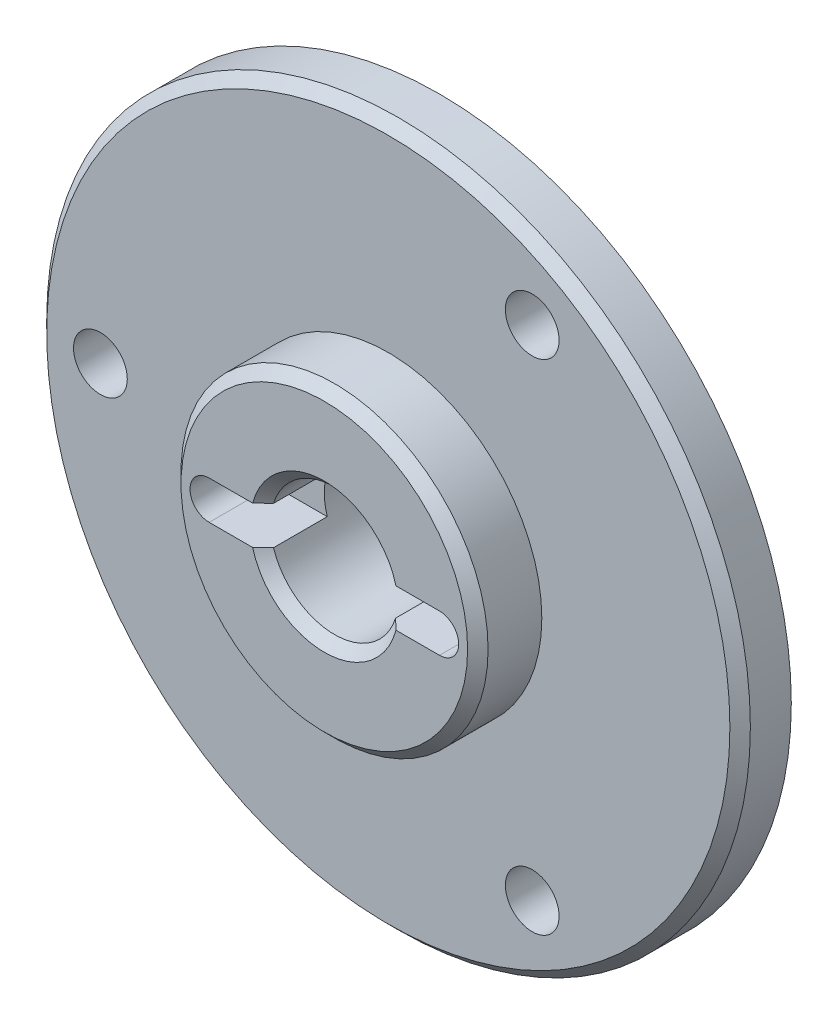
ISO-10303-21;
HEADER;
FILE_DESCRIPTION(('STEP AP214'),'2;1');
FILE_NAME('part.step','',(''),(''),'','','');
FILE_SCHEMA(('AUTOMOTIVE_DESIGN { 1 0 10303 214 1 1 1 1 }'));
ENDSEC;
DATA;
#1=APPLICATION_CONTEXT('core data for automotive mechanical design processes');
#2=APPLICATION_PROTOCOL_DEFINITION('international standard','automotive_design',2000,#1);
#3=PRODUCT_CONTEXT('',#1,'mechanical');
#4=PRODUCT('Part','Part','',(#3));
#5=PRODUCT_RELATED_PRODUCT_CATEGORY('part','',(#4));
#6=PRODUCT_DEFINITION_FORMATION('','',#4);
#7=PRODUCT_DEFINITION_CONTEXT('part definition',#1,'design');
#8=PRODUCT_DEFINITION('design','',#6,#7);
#9=PRODUCT_DEFINITION_SHAPE('','',#8);
#10=(LENGTH_UNIT() NAMED_UNIT(*) SI_UNIT(.MILLI.,.METRE.));
#11=(NAMED_UNIT(*) PLANE_ANGLE_UNIT() SI_UNIT($,.RADIAN.));
#12=(NAMED_UNIT(*) SI_UNIT($,.STERADIAN.) SOLID_ANGLE_UNIT());
#13=UNCERTAINTY_MEASURE_WITH_UNIT(LENGTH_MEASURE(1.E-05),#10,'distance_accuracy_value','');
#14=(GEOMETRIC_REPRESENTATION_CONTEXT(3) GLOBAL_UNCERTAINTY_ASSIGNED_CONTEXT((#13)) GLOBAL_UNIT_ASSIGNED_CONTEXT((#10,
#11,#12)) REPRESENTATION_CONTEXT('',''));
#15=CARTESIAN_POINT('',(0.,0.,0.));
#16=DIRECTION('',(0.,0.,1.));
#17=DIRECTION('',(1.,0.,0.));
#18=AXIS2_PLACEMENT_3D('',#15,#16,#17);
#19=CARTESIAN_POINT('',(0.,0.,4.));
#20=DIRECTION('',(0.,0.,1.));
#21=DIRECTION('',(1.,0.,0.));
#22=AXIS2_PLACEMENT_3D('',#19,#20,#21);
#23=PLANE('',#22);
#24=CARTESIAN_POINT('',(0.,0.,4.));
#25=DIRECTION('',(0.,0.,1.));
#26=DIRECTION('',(1.,0.,0.));
#27=AXIS2_PLACEMENT_3D('',#24,#25,#26);
#28=CIRCLE('',#27,26.7);
#29=CARTESIAN_POINT('',(26.7,0.,4.));
#30=VERTEX_POINT('',#29);
#31=EDGE_CURVE('E468',#30,#30,#28,.T.);
#32=ORIENTED_EDGE('',*,*,#31,.T.);
#33=EDGE_LOOP('',(#32));
#34=FACE_BOUND('',#33,.T.);
#35=CARTESIAN_POINT('',(11.2499999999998,19.48557158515,4.));
#36=DIRECTION('',(0.,0.,1.));
#37=DIRECTION('',(1.,0.,0.));
#38=AXIS2_PLACEMENT_3D('',#35,#36,#37);
#39=CIRCLE('',#38,2.09999999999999);
#40=CARTESIAN_POINT('',(13.3499999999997,19.48557158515,4.));
#41=VERTEX_POINT('',#40);
#42=EDGE_CURVE('E203',#41,#41,#39,.T.);
#43=ORIENTED_EDGE('',*,*,#42,.F.);
#44=EDGE_LOOP('',(#43));
#45=FACE_BOUND('',#44,.T.);
#46=CARTESIAN_POINT('',(-22.5,0.,4.));
#47=DIRECTION('',(0.,0.,1.));
#48=DIRECTION('',(1.,0.,0.));
#49=AXIS2_PLACEMENT_3D('',#46,#47,#48);
#50=CIRCLE('',#49,2.09999999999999);
#51=CARTESIAN_POINT('',(-20.4,0.,4.));
#52=VERTEX_POINT('',#51);
#53=EDGE_CURVE('E198',#52,#52,#50,.T.);
#54=ORIENTED_EDGE('',*,*,#53,.F.);
#55=EDGE_LOOP('',(#54));
#56=FACE_BOUND('',#55,.T.);
#57=CARTESIAN_POINT('',(11.2500000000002,-19.4855715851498,4.));
#58=DIRECTION('',(0.,0.,1.));
#59=DIRECTION('',(1.,0.,0.));
#60=AXIS2_PLACEMENT_3D('',#57,#58,#59);
#61=CIRCLE('',#60,2.09999999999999);
#62=CARTESIAN_POINT('',(13.3500000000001,-19.4855715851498,4.));
#63=VERTEX_POINT('',#62);
#64=EDGE_CURVE('E157',#63,#63,#61,.T.);
#65=ORIENTED_EDGE('',*,*,#64,.F.);
#66=EDGE_LOOP('',(#65));
#67=FACE_BOUND('',#66,.T.);
#68=CARTESIAN_POINT('',(0.,0.,4.));
#69=DIRECTION('',(0.,0.,1.));
#70=DIRECTION('',(1.,0.,0.));
#71=AXIS2_PLACEMENT_3D('',#68,#69,#70);
#72=CIRCLE('',#71,12.);
#73=CARTESIAN_POINT('',(12.,0.,4.));
#74=VERTEX_POINT('',#73);
#75=EDGE_CURVE('E176',#74,#74,#72,.T.);
#76=ORIENTED_EDGE('',*,*,#75,.F.);
#77=EDGE_LOOP('',(#76));
#78=FACE_BOUND('',#77,.T.);
#79=ADVANCED_FACE('F36',(#34,#45,#56,#67,#78),#23,.T.);
#80=CARTESIAN_POINT('',(0.,0.,0.));
#81=DIRECTION('',(0.,0.,1.));
#82=DIRECTION('',(1.,0.,0.));
#83=AXIS2_PLACEMENT_3D('',#80,#81,#82);
#84=PLANE('',#83);
#85=CARTESIAN_POINT('',(-11.2499999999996,-19.4855715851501,0.));
#86=DIRECTION('',(0.,0.,1.));
#87=DIRECTION('',(1.,0.,0.));
#88=AXIS2_PLACEMENT_3D('',#85,#86,#87);
#89=CIRCLE('',#88,2.4);
#90=CARTESIAN_POINT('',(-8.84999999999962,-19.4855715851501,0.));
#91=VERTEX_POINT('',#90);
#92=EDGE_CURVE('E214',#91,#91,#89,.F.);
#93=ORIENTED_EDGE('',*,*,#92,.F.);
#94=EDGE_LOOP('',(#93));
#95=FACE_BOUND('',#94,.T.);
#96=CARTESIAN_POINT('',(22.5,2.33432690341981E-13,0.));
#97=DIRECTION('',(0.,0.,1.));
#98=DIRECTION('',(1.,0.,0.));
#99=AXIS2_PLACEMENT_3D('',#96,#97,#98);
#100=CIRCLE('',#99,2.4);
#101=CARTESIAN_POINT('',(24.9,2.33432690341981E-13,0.));
#102=VERTEX_POINT('',#101);
#103=EDGE_CURVE('E211',#102,#102,#100,.F.);
#104=ORIENTED_EDGE('',*,*,#103,.F.);
#105=EDGE_LOOP('',(#104));
#106=FACE_BOUND('',#105,.T.);
#107=CARTESIAN_POINT('',(-11.2500000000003,19.4855715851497,0.));
#108=DIRECTION('',(0.,0.,1.));
#109=DIRECTION('',(1.,0.,0.));
#110=AXIS2_PLACEMENT_3D('',#107,#108,#109);
#111=CIRCLE('',#110,2.4);
#112=CARTESIAN_POINT('',(-8.85000000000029,19.4855715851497,0.));
#113=VERTEX_POINT('',#112);
#114=EDGE_CURVE('E208',#113,#113,#111,.F.);
#115=ORIENTED_EDGE('',*,*,#114,.F.);
#116=EDGE_LOOP('',(#115));
#117=FACE_BOUND('',#116,.T.);
#118=CARTESIAN_POINT('',(11.2499999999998,19.48557158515,0.));
#119=DIRECTION('',(0.,0.,-1.));
#120=DIRECTION('',(-1.,0.,0.));
#121=AXIS2_PLACEMENT_3D('',#118,#119,#120);
#122=CIRCLE('',#121,2.65);
#123=CARTESIAN_POINT('',(8.59999999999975,19.48557158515,0.));
#124=VERTEX_POINT('',#123);
#125=EDGE_CURVE('E390',#124,#124,#122,.T.);
#126=ORIENTED_EDGE('',*,*,#125,.F.);
#127=EDGE_LOOP('',(#126));
#128=FACE_BOUND('',#127,.T.);
#129=CARTESIAN_POINT('',(-22.5,0.,0.));
#130=DIRECTION('',(0.,0.,-1.));
#131=DIRECTION('',(-1.,0.,0.));
#132=AXIS2_PLACEMENT_3D('',#129,#130,#131);
#133=CIRCLE('',#132,2.65);
#134=CARTESIAN_POINT('',(-25.15,0.,0.));
#135=VERTEX_POINT('',#134);
#136=EDGE_CURVE('E206',#135,#135,#133,.T.);
#137=ORIENTED_EDGE('',*,*,#136,.F.);
#138=EDGE_LOOP('',(#137));
#139=FACE_BOUND('',#138,.T.);
#140=CARTESIAN_POINT('',(11.2500000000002,-19.4855715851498,0.));
#141=DIRECTION('',(0.,0.,-1.));
#142=DIRECTION('',(-1.,0.,0.));
#143=AXIS2_PLACEMENT_3D('',#140,#141,#142);
#144=CIRCLE('',#143,2.65);
#145=CARTESIAN_POINT('',(8.60000000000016,-19.4855715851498,0.));
#146=VERTEX_POINT('',#145);
#147=EDGE_CURVE('E201',#146,#146,#144,.T.);
#148=ORIENTED_EDGE('',*,*,#147,.F.);
#149=EDGE_LOOP('',(#148));
#150=FACE_BOUND('',#149,.T.);
#151=CARTESIAN_POINT('',(0.,0.,0.));
#152=DIRECTION('',(0.,0.,1.));
#153=DIRECTION('',(1.,0.,0.));
#154=AXIS2_PLACEMENT_3D('',#151,#152,#153);
#155=CIRCLE('',#154,27.5);
#156=CARTESIAN_POINT('',(27.5,0.,0.));
#157=VERTEX_POINT('',#156);
#158=EDGE_CURVE('E182',#157,#157,#155,.T.);
#159=ORIENTED_EDGE('',*,*,#158,.F.);
#160=EDGE_LOOP('',(#159));
#161=FACE_BOUND('',#160,.T.);
#162=CARTESIAN_POINT('',(0.,0.,0.));
#163=DIRECTION('',(0.,0.,1.));
#164=DIRECTION('',(1.,0.,0.));
#165=AXIS2_PLACEMENT_3D('',#162,#163,#164);
#166=CIRCLE('',#165,9.9);
#167=CARTESIAN_POINT('',(9.9,0.,0.));
#168=VERTEX_POINT('',#167);
#169=EDGE_CURVE('E185',#168,#168,#166,.F.);
#170=ORIENTED_EDGE('',*,*,#169,.F.);
#171=EDGE_LOOP('',(#170));
#172=FACE_BOUND('',#171,.T.);
#173=ADVANCED_FACE('F282',(#95,#106,#117,#128,#139,#150,#161,#172),#84,.F.);
#174=CARTESIAN_POINT('',(0.,0.,4.));
#175=DIRECTION('',(0.,0.,-1.));
#176=DIRECTION('',(-1.,0.,0.));
#177=AXIS2_PLACEMENT_3D('',#174,#175,#176);
#178=CYLINDRICAL_SURFACE('',#177,27.5);
#179=CARTESIAN_POINT('',(0.,0.,3.20000000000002));
#180=DIRECTION('',(0.,0.,1.));
#181=DIRECTION('',(1.,0.,0.));
#182=AXIS2_PLACEMENT_3D('',#179,#180,#181);
#183=CIRCLE('',#182,27.5);
#184=CARTESIAN_POINT('',(27.5,0.,3.20000000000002));
#185=VERTEX_POINT('',#184);
#186=EDGE_CURVE('E428',#185,#185,#183,.F.);
#187=ORIENTED_EDGE('',*,*,#186,.T.);
#188=EDGE_LOOP('',(#187));
#189=FACE_BOUND('',#188,.T.);
#190=ORIENTED_EDGE('',*,*,#158,.T.);
#191=EDGE_LOOP('',(#190));
#192=FACE_BOUND('',#191,.T.);
#193=ADVANCED_FACE('F278',(#189,#192),#178,.T.);
#194=CARTESIAN_POINT('',(0.,0.,4.));
#195=DIRECTION('',(0.,0.,-1.));
#196=DIRECTION('',(-1.,0.,0.));
#197=AXIS2_PLACEMENT_3D('',#194,#195,#196);
#198=CYLINDRICAL_SURFACE('',#197,5.);
#199=DIRECTION('',(0.,0.,-1.));
#200=VECTOR('',#199,1.);
#201=CARTESIAN_POINT('',(-4.76969600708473,-1.5,4.));
#202=LINE('',#201,#200);
#203=CARTESIAN_POINT('',(-4.76969600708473,-1.5,8.20000000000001));
#204=VERTEX_POINT('',#203);
#205=CARTESIAN_POINT('',(-4.76969600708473,-1.5,4.));
#206=VERTEX_POINT('',#205);
#207=EDGE_CURVE('E133',#204,#206,#202,.T.);
#208=ORIENTED_EDGE('',*,*,#207,.F.);
#209=CARTESIAN_POINT('',(0.,0.,8.20000000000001));
#210=DIRECTION('',(0.,0.,1.));
#211=DIRECTION('',(1.,0.,0.));
#212=AXIS2_PLACEMENT_3D('',#209,#210,#211);
#213=CIRCLE('',#212,5.);
#214=CARTESIAN_POINT('',(4.76969600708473,-1.5,8.20000000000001));
#215=VERTEX_POINT('',#214);
#216=EDGE_CURVE('E230',#204,#215,#213,.T.);
#217=ORIENTED_EDGE('',*,*,#216,.T.);
#218=DIRECTION('',(0.,0.,-1.));
#219=VECTOR('',#218,1.);
#220=CARTESIAN_POINT('',(4.76969600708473,-1.5,4.));
#221=LINE('',#220,#219);
#222=CARTESIAN_POINT('',(4.76969600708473,-1.5,4.));
#223=VERTEX_POINT('',#222);
#224=EDGE_CURVE('E163',#223,#215,#221,.F.);
#225=ORIENTED_EDGE('',*,*,#224,.F.);
#226=CARTESIAN_POINT('',(0.,0.,4.));
#227=DIRECTION('',(0.,0.,1.));
#228=DIRECTION('',(1.,0.,0.));
#229=AXIS2_PLACEMENT_3D('',#226,#227,#228);
#230=CIRCLE('',#229,5.);
#231=CARTESIAN_POINT('',(4.76969600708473,1.5,4.));
#232=VERTEX_POINT('',#231);
#233=EDGE_CURVE('E192',#223,#232,#230,.T.);
#234=ORIENTED_EDGE('',*,*,#233,.T.);
#235=DIRECTION('',(0.,0.,-1.));
#236=VECTOR('',#235,1.);
#237=CARTESIAN_POINT('',(4.76969600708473,1.5,4.));
#238=LINE('',#237,#236);
#239=CARTESIAN_POINT('',(4.76969600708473,1.5,8.20000000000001));
#240=VERTEX_POINT('',#239);
#241=EDGE_CURVE('E174',#240,#232,#238,.T.);
#242=ORIENTED_EDGE('',*,*,#241,.F.);
#243=CARTESIAN_POINT('',(0.,0.,8.20000000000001));
#244=DIRECTION('',(0.,0.,1.));
#245=DIRECTION('',(1.,0.,0.));
#246=AXIS2_PLACEMENT_3D('',#243,#244,#245);
#247=CIRCLE('',#246,5.);
#248=CARTESIAN_POINT('',(-4.76969600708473,1.5,8.20000000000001));
#249=VERTEX_POINT('',#248);
#250=EDGE_CURVE('E227',#240,#249,#247,.T.);
#251=ORIENTED_EDGE('',*,*,#250,.T.);
#252=DIRECTION('',(0.,0.,-1.));
#253=VECTOR('',#252,1.);
#254=CARTESIAN_POINT('',(-4.76969600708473,1.5,4.));
#255=LINE('',#254,#253);
#256=CARTESIAN_POINT('',(-4.76969600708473,1.5,4.));
#257=VERTEX_POINT('',#256);
#258=EDGE_CURVE('E171',#257,#249,#255,.F.);
#259=ORIENTED_EDGE('',*,*,#258,.F.);
#260=EDGE_CURVE('E195',#257,#206,#230,.T.);
#261=ORIENTED_EDGE('',*,*,#260,.T.);
#262=EDGE_LOOP('',(#208,#217,#225,#234,#242,#251,#259,#261));
#263=FACE_BOUND('',#262,.T.);
#264=CARTESIAN_POINT('',(0.,0.,-12.));
#265=DIRECTION('',(0.,0.,-1.));
#266=DIRECTION('',(-1.,0.,0.));
#267=AXIS2_PLACEMENT_3D('',#264,#265,#266);
#268=CIRCLE('',#267,5.);
#269=CARTESIAN_POINT('',(-5.,0.,-12.));
#270=VERTEX_POINT('',#269);
#271=EDGE_CURVE('E179',#270,#270,#268,.T.);
#272=ORIENTED_EDGE('',*,*,#271,.T.);
#273=EDGE_LOOP('',(#272));
#274=FACE_BOUND('',#273,.T.);
#275=ADVANCED_FACE('F271',(#263,#274),#198,.F.);
#276=CARTESIAN_POINT('',(0.,0.,-12.));
#277=DIRECTION('',(0.,0.,-1.));
#278=DIRECTION('',(-1.,0.,0.));
#279=AXIS2_PLACEMENT_3D('',#276,#277,#278);
#280=PLANE('',#279);
#281=CARTESIAN_POINT('',(0.,0.,-12.));
#282=DIRECTION('',(0.,0.,-1.));
#283=DIRECTION('',(-1.,0.,0.));
#284=AXIS2_PLACEMENT_3D('',#281,#282,#283);
#285=CIRCLE('',#284,9.10000000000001);
#286=CARTESIAN_POINT('',(-9.10000000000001,0.,-12.));
#287=VERTEX_POINT('',#286);
#288=EDGE_CURVE('E313',#287,#287,#285,.T.);
#289=ORIENTED_EDGE('',*,*,#288,.T.);
#290=EDGE_LOOP('',(#289));
#291=FACE_BOUND('',#290,.T.);
#292=ORIENTED_EDGE('',*,*,#271,.F.);
#293=EDGE_LOOP('',(#292));
#294=FACE_BOUND('',#293,.T.);
#295=ADVANCED_FACE('F268',(#291,#294),#280,.T.);
#296=CARTESIAN_POINT('',(0.,0.,-12.));
#297=DIRECTION('',(0.,0.,1.));
#298=DIRECTION('',(1.,0.,0.));
#299=AXIS2_PLACEMENT_3D('',#296,#297,#298);
#300=CYLINDRICAL_SURFACE('',#299,9.9);
#301=CARTESIAN_POINT('',(0.,0.,-11.2));
#302=DIRECTION('',(0.,0.,-1.));
#303=DIRECTION('',(-1.,0.,0.));
#304=AXIS2_PLACEMENT_3D('',#301,#302,#303);
#305=CIRCLE('',#304,9.9);
#306=CARTESIAN_POINT('',(-9.9,0.,-11.2));
#307=VERTEX_POINT('',#306);
#308=EDGE_CURVE('E465',#307,#307,#305,.F.);
#309=ORIENTED_EDGE('',*,*,#308,.T.);
#310=EDGE_LOOP('',(#309));
#311=FACE_BOUND('',#310,.T.);
#312=ORIENTED_EDGE('',*,*,#169,.T.);
#313=EDGE_LOOP('',(#312));
#314=FACE_BOUND('',#313,.T.);
#315=ADVANCED_FACE('F263',(#311,#314),#300,.T.);
#316=CARTESIAN_POINT('',(0.,0.,9.));
#317=DIRECTION('',(0.,0.,1.));
#318=DIRECTION('',(1.,0.,0.));
#319=AXIS2_PLACEMENT_3D('',#316,#317,#318);
#320=PLANE('',#319);
#321=CARTESIAN_POINT('',(0.,0.,9.));
#322=DIRECTION('',(0.,0.,1.));
#323=DIRECTION('',(1.,0.,0.));
#324=AXIS2_PLACEMENT_3D('',#321,#322,#323);
#325=CIRCLE('',#324,11.2);
#326=CARTESIAN_POINT('',(11.2,0.,9.));
#327=VERTEX_POINT('',#326);
#328=EDGE_CURVE('E221',#327,#327,#325,.T.);
#329=ORIENTED_EDGE('',*,*,#328,.T.);
#330=EDGE_LOOP('',(#329));
#331=FACE_BOUND('',#330,.T.);
#332=DIRECTION('',(1.,0.,0.));
#333=VECTOR('',#332,1.);
#334=CARTESIAN_POINT('',(0.,-1.5,9.));
#335=LINE('',#334,#333);
#336=CARTESIAN_POINT('',(5.60267793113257,-1.5,9.));
#337=VERTEX_POINT('',#336);
#338=CARTESIAN_POINT('',(9.,-1.5,9.));
#339=VERTEX_POINT('',#338);
#340=EDGE_CURVE('E188',#337,#339,#335,.T.);
#341=ORIENTED_EDGE('',*,*,#340,.F.);
#342=CARTESIAN_POINT('',(0.,0.,9.));
#343=DIRECTION('',(0.,0.,1.));
#344=DIRECTION('',(1.,0.,0.));
#345=AXIS2_PLACEMENT_3D('',#342,#343,#344);
#346=CIRCLE('',#345,5.79999999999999);
#347=CARTESIAN_POINT('',(-5.60267793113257,-1.5,9.));
#348=VERTEX_POINT('',#347);
#349=EDGE_CURVE('E219',#337,#348,#346,.F.);
#350=ORIENTED_EDGE('',*,*,#349,.T.);
#351=DIRECTION('',(1.,0.,0.));
#352=VECTOR('',#351,1.);
#353=CARTESIAN_POINT('',(-9.,-1.5,9.));
#354=LINE('',#353,#352);
#355=CARTESIAN_POINT('',(-9.,-1.5,9.));
#356=VERTEX_POINT('',#355);
#357=EDGE_CURVE('E156',#356,#348,#354,.T.);
#358=ORIENTED_EDGE('',*,*,#357,.F.);
#359=CARTESIAN_POINT('',(-9.,0.,9.));
#360=DIRECTION('',(0.,0.,1.));
#361=DIRECTION('',(1.,0.,0.));
#362=AXIS2_PLACEMENT_3D('',#359,#360,#361);
#363=CIRCLE('',#362,1.5);
#364=CARTESIAN_POINT('',(-9.,1.5,9.));
#365=VERTEX_POINT('',#364);
#366=EDGE_CURVE('E122',#365,#356,#363,.T.);
#367=ORIENTED_EDGE('',*,*,#366,.F.);
#368=DIRECTION('',(-1.,0.,0.));
#369=VECTOR('',#368,1.);
#370=CARTESIAN_POINT('',(0.,1.5,9.));
#371=LINE('',#370,#369);
#372=CARTESIAN_POINT('',(-5.60267793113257,1.5,9.));
#373=VERTEX_POINT('',#372);
#374=EDGE_CURVE('E190',#373,#365,#371,.T.);
#375=ORIENTED_EDGE('',*,*,#374,.F.);
#376=CARTESIAN_POINT('',(0.,0.,9.));
#377=DIRECTION('',(0.,0.,1.));
#378=DIRECTION('',(1.,0.,0.));
#379=AXIS2_PLACEMENT_3D('',#376,#377,#378);
#380=CIRCLE('',#379,5.79999999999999);
#381=CARTESIAN_POINT('',(5.60267793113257,1.5,9.));
#382=VERTEX_POINT('',#381);
#383=EDGE_CURVE('E217',#373,#382,#380,.F.);
#384=ORIENTED_EDGE('',*,*,#383,.T.);
#385=DIRECTION('',(-1.,0.,0.));
#386=VECTOR('',#385,1.);
#387=CARTESIAN_POINT('',(-9.,1.5,9.));
#388=LINE('',#387,#386);
#389=CARTESIAN_POINT('',(9.,1.5,9.));
#390=VERTEX_POINT('',#389);
#391=EDGE_CURVE('E143',#390,#382,#388,.T.);
#392=ORIENTED_EDGE('',*,*,#391,.F.);
#393=CARTESIAN_POINT('',(9.,0.,9.));
#394=DIRECTION('',(0.,0.,1.));
#395=DIRECTION('',(1.,0.,0.));
#396=AXIS2_PLACEMENT_3D('',#393,#394,#395);
#397=CIRCLE('',#396,1.5);
#398=EDGE_CURVE('E145',#339,#390,#397,.T.);
#399=ORIENTED_EDGE('',*,*,#398,.F.);
#400=EDGE_LOOP('',(#341,#350,#358,#367,#375,#384,#392,#399));
#401=FACE_BOUND('',#400,.T.);
#402=ADVANCED_FACE('F260',(#331,#401),#320,.T.);
#403=CARTESIAN_POINT('',(0.,0.,9.));
#404=DIRECTION('',(0.,0.,-1.));
#405=DIRECTION('',(-1.,0.,0.));
#406=AXIS2_PLACEMENT_3D('',#403,#404,#405);
#407=CYLINDRICAL_SURFACE('',#406,12.);
#408=CARTESIAN_POINT('',(0.,0.,8.20000000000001));
#409=DIRECTION('',(0.,0.,1.));
#410=DIRECTION('',(1.,0.,0.));
#411=AXIS2_PLACEMENT_3D('',#408,#409,#410);
#412=CIRCLE('',#411,12.);
#413=CARTESIAN_POINT('',(12.,0.,8.20000000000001));
#414=VERTEX_POINT('',#413);
#415=EDGE_CURVE('E224',#414,#414,#412,.F.);
#416=ORIENTED_EDGE('',*,*,#415,.T.);
#417=EDGE_LOOP('',(#416));
#418=FACE_BOUND('',#417,.T.);
#419=ORIENTED_EDGE('',*,*,#75,.T.);
#420=EDGE_LOOP('',(#419));
#421=FACE_BOUND('',#420,.T.);
#422=ADVANCED_FACE('F253',(#418,#421),#407,.T.);
#423=CARTESIAN_POINT('',(-9.,-1.5,4.));
#424=DIRECTION('',(0.,-1.,0.));
#425=DIRECTION('',(1.,0.,0.));
#426=AXIS2_PLACEMENT_3D('',#423,#424,#425);
#427=PLANE('',#426);
#428=ORIENTED_EDGE('',*,*,#224,.T.);
#429=CARTESIAN_POINT('',(4.76969600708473,-1.5,8.20000000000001));
#430=CARTESIAN_POINT('',(4.83933557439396,-1.5,8.26643268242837));
#431=CARTESIAN_POINT('',(4.90891049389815,-1.5,8.33293307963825));
#432=CARTESIAN_POINT('',(5.04794406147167,-1.5,8.46605497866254));
#433=CARTESIAN_POINT('',(5.11740270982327,-1.5,8.53267648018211));
#434=CARTESIAN_POINT('',(5.25621706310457,-1.5,8.66602655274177));
#435=CARTESIAN_POINT('',(5.32557276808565,-1.5,8.73275512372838));
#436=CARTESIAN_POINT('',(5.46419194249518,-1.5,8.86630834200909));
#437=CARTESIAN_POINT('',(5.53345541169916,-1.5,8.93313298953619));
#438=CARTESIAN_POINT('',(5.60267793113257,-1.5,9.));
#439=B_SPLINE_CURVE_WITH_KNOTS('',3,(#429,#430,#431,#432,#433,#434,#435,#436,#437,#438),
.UNSPECIFIED.,.F.,.F.,(4,2,2,2,4),(0.,0.28873288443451,0.577465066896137,0.866197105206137,
1.15492984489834),.UNSPECIFIED.);
#440=EDGE_CURVE('E59',#215,#337,#439,.T.);
#441=ORIENTED_EDGE('',*,*,#440,.T.);
#442=ORIENTED_EDGE('',*,*,#340,.T.);
#443=DIRECTION('',(0.,0.,1.));
#444=VECTOR('',#443,1.);
#445=CARTESIAN_POINT('',(9.,-1.5,4.));
#446=LINE('',#445,#444);
#447=CARTESIAN_POINT('',(9.,-1.5,4.));
#448=VERTEX_POINT('',#447);
#449=EDGE_CURVE('E126',#448,#339,#446,.T.);
#450=ORIENTED_EDGE('',*,*,#449,.F.);
#451=DIRECTION('',(1.,0.,0.));
#452=VECTOR('',#451,1.);
#453=CARTESIAN_POINT('',(-9.,-1.5,4.));
#454=LINE('',#453,#452);
#455=EDGE_CURVE('E137',#223,#448,#454,.T.);
#456=ORIENTED_EDGE('',*,*,#455,.F.);
#457=EDGE_LOOP('',(#428,#441,#442,#450,#456));
#458=FACE_BOUND('',#457,.T.);
#459=ADVANCED_FACE('F247',(#458),#427,.F.);
#460=CARTESIAN_POINT('',(9.,0.,4.));
#461=DIRECTION('',(0.,0.,1.));
#462=DIRECTION('',(1.,0.,0.));
#463=AXIS2_PLACEMENT_3D('',#460,#461,#462);
#464=CYLINDRICAL_SURFACE('',#463,1.5);
#465=ORIENTED_EDGE('',*,*,#398,.T.);
#466=DIRECTION('',(0.,0.,1.));
#467=VECTOR('',#466,1.);
#468=CARTESIAN_POINT('',(9.,1.5,4.));
#469=LINE('',#468,#467);
#470=CARTESIAN_POINT('',(9.,1.5,4.));
#471=VERTEX_POINT('',#470);
#472=EDGE_CURVE('E164',#471,#390,#469,.T.);
#473=ORIENTED_EDGE('',*,*,#472,.F.);
#474=CARTESIAN_POINT('',(9.,0.,4.));
#475=DIRECTION('',(0.,0.,1.));
#476=DIRECTION('',(1.,0.,0.));
#477=AXIS2_PLACEMENT_3D('',#474,#475,#476);
#478=CIRCLE('',#477,1.5);
#479=EDGE_CURVE('E136',#448,#471,#478,.T.);
#480=ORIENTED_EDGE('',*,*,#479,.F.);
#481=ORIENTED_EDGE('',*,*,#449,.T.);
#482=EDGE_LOOP('',(#465,#473,#480,#481));
#483=FACE_BOUND('',#482,.T.);
#484=ADVANCED_FACE('F252',(#483),#464,.F.);
#485=CARTESIAN_POINT('',(-9.,1.5,4.));
#486=DIRECTION('',(0.,1.,0.));
#487=DIRECTION('',(-1.,0.,0.));
#488=AXIS2_PLACEMENT_3D('',#485,#486,#487);
#489=PLANE('',#488);
#490=ORIENTED_EDGE('',*,*,#391,.T.);
#491=CARTESIAN_POINT('',(5.60267793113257,1.5,9.));
#492=CARTESIAN_POINT('',(5.53345541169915,1.5,8.93313298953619));
#493=CARTESIAN_POINT('',(5.46419194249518,1.5,8.86630834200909));
#494=CARTESIAN_POINT('',(5.32557276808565,1.5,8.73275512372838));
#495=CARTESIAN_POINT('',(5.25621706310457,1.5,8.66602655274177));
#496=CARTESIAN_POINT('',(5.11740270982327,1.5,8.53267648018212));
#497=CARTESIAN_POINT('',(5.04794406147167,1.5,8.46605497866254));
#498=CARTESIAN_POINT('',(4.90891049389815,1.5,8.33293307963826));
#499=CARTESIAN_POINT('',(4.83933557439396,1.5,8.26643268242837));
#500=CARTESIAN_POINT('',(4.76969600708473,1.5,8.20000000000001));
#501=B_SPLINE_CURVE_WITH_KNOTS('',3,(#491,#492,#493,#494,#495,#496,#497,#498,#499,#500),
.UNSPECIFIED.,.F.,.F.,(4,2,2,2,4),(0.,0.2887327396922,0.5774647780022,0.866196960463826,
1.15492984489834),.UNSPECIFIED.);
#502=EDGE_CURVE('E51',#382,#240,#501,.T.);
#503=ORIENTED_EDGE('',*,*,#502,.T.);
#504=ORIENTED_EDGE('',*,*,#241,.T.);
#505=DIRECTION('',(-1.,0.,0.));
#506=VECTOR('',#505,1.);
#507=CARTESIAN_POINT('',(-9.,1.5,4.));
#508=LINE('',#507,#506);
#509=EDGE_CURVE('E127',#471,#232,#508,.T.);
#510=ORIENTED_EDGE('',*,*,#509,.F.);
#511=ORIENTED_EDGE('',*,*,#472,.T.);
#512=EDGE_LOOP('',(#490,#503,#504,#510,#511));
#513=FACE_BOUND('',#512,.T.);
#514=ADVANCED_FACE('F328',(#513),#489,.F.);
#515=CARTESIAN_POINT('',(-9.,0.,4.));
#516=DIRECTION('',(0.,0.,1.));
#517=DIRECTION('',(1.,0.,0.));
#518=AXIS2_PLACEMENT_3D('',#515,#516,#517);
#519=PLANE('',#518);
#520=ORIENTED_EDGE('',*,*,#455,.T.);
#521=ORIENTED_EDGE('',*,*,#479,.T.);
#522=ORIENTED_EDGE('',*,*,#509,.T.);
#523=ORIENTED_EDGE('',*,*,#233,.F.);
#524=EDGE_LOOP('',(#520,#521,#522,#523));
#525=FACE_BOUND('',#524,.T.);
#526=ADVANCED_FACE('F329',(#525),#519,.T.);
#527=CARTESIAN_POINT('',(-9.,1.5,4.));
#528=VERTEX_POINT('',#527);
#529=EDGE_CURVE('E141',#257,#528,#508,.T.);
#530=ORIENTED_EDGE('',*,*,#529,.T.);
#531=CARTESIAN_POINT('',(-9.,0.,4.));
#532=DIRECTION('',(0.,0.,1.));
#533=DIRECTION('',(1.,0.,0.));
#534=AXIS2_PLACEMENT_3D('',#531,#532,#533);
#535=CIRCLE('',#534,1.5);
#536=CARTESIAN_POINT('',(-9.,-1.5,4.));
#537=VERTEX_POINT('',#536);
#538=EDGE_CURVE('E120',#528,#537,#535,.T.);
#539=ORIENTED_EDGE('',*,*,#538,.T.);
#540=EDGE_CURVE('E130',#537,#206,#454,.T.);
#541=ORIENTED_EDGE('',*,*,#540,.T.);
#542=ORIENTED_EDGE('',*,*,#260,.F.);
#543=EDGE_LOOP('',(#530,#539,#541,#542));
#544=FACE_BOUND('',#543,.T.);
#545=ADVANCED_FACE('F139',(#544),#519,.T.);
#546=ORIENTED_EDGE('',*,*,#357,.T.);
#547=CARTESIAN_POINT('',(-5.60267793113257,-1.5,9.));
#548=CARTESIAN_POINT('',(-5.53345541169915,-1.5,8.93313298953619));
#549=CARTESIAN_POINT('',(-5.46419194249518,-1.5,8.86630834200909));
#550=CARTESIAN_POINT('',(-5.32557276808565,-1.5,8.73275512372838));
#551=CARTESIAN_POINT('',(-5.25621706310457,-1.5,8.66602655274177));
#552=CARTESIAN_POINT('',(-5.11740270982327,-1.5,8.53267648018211));
#553=CARTESIAN_POINT('',(-5.04794406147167,-1.5,8.46605497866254));
#554=CARTESIAN_POINT('',(-4.90891049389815,-1.5,8.33293307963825));
#555=CARTESIAN_POINT('',(-4.83933557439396,-1.5,8.26643268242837));
#556=CARTESIAN_POINT('',(-4.76969600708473,-1.5,8.20000000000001));
#557=B_SPLINE_CURVE_WITH_KNOTS('',3,(#547,#548,#549,#550,#551,#552,#553,#554,#555,#556),
.UNSPECIFIED.,.F.,.F.,(4,2,2,2,4),(0.,0.2887327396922,0.577464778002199,0.866196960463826,
1.15492984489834),.UNSPECIFIED.);
#558=EDGE_CURVE('E238',#348,#204,#557,.T.);
#559=ORIENTED_EDGE('',*,*,#558,.T.);
#560=ORIENTED_EDGE('',*,*,#207,.T.);
#561=ORIENTED_EDGE('',*,*,#540,.F.);
#562=DIRECTION('',(0.,0.,1.));
#563=VECTOR('',#562,1.);
#564=CARTESIAN_POINT('',(-9.,-1.5,4.));
#565=LINE('',#564,#563);
#566=EDGE_CURVE('E115',#537,#356,#565,.T.);
#567=ORIENTED_EDGE('',*,*,#566,.T.);
#568=EDGE_LOOP('',(#546,#559,#560,#561,#567));
#569=FACE_BOUND('',#568,.T.);
#570=ADVANCED_FACE('F131',(#569),#427,.F.);
#571=CARTESIAN_POINT('',(-9.,0.,4.));
#572=DIRECTION('',(0.,0.,1.));
#573=DIRECTION('',(1.,0.,0.));
#574=AXIS2_PLACEMENT_3D('',#571,#572,#573);
#575=CYLINDRICAL_SURFACE('',#574,1.5);
#576=ORIENTED_EDGE('',*,*,#366,.T.);
#577=ORIENTED_EDGE('',*,*,#566,.F.);
#578=ORIENTED_EDGE('',*,*,#538,.F.);
#579=DIRECTION('',(0.,0.,1.));
#580=VECTOR('',#579,1.);
#581=CARTESIAN_POINT('',(-9.,1.5,4.));
#582=LINE('',#581,#580);
#583=EDGE_CURVE('E161',#528,#365,#582,.T.);
#584=ORIENTED_EDGE('',*,*,#583,.T.);
#585=EDGE_LOOP('',(#576,#577,#578,#584));
#586=FACE_BOUND('',#585,.T.);
#587=ADVANCED_FACE('F117',(#586),#575,.F.);
#588=ORIENTED_EDGE('',*,*,#258,.T.);
#589=CARTESIAN_POINT('',(-4.76969600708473,1.5,8.20000000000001));
#590=CARTESIAN_POINT('',(-4.83933557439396,1.5,8.26643268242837));
#591=CARTESIAN_POINT('',(-4.90891049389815,1.5,8.33293307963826));
#592=CARTESIAN_POINT('',(-5.04794406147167,1.5,8.46605497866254));
#593=CARTESIAN_POINT('',(-5.11740270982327,1.5,8.53267648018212));
#594=CARTESIAN_POINT('',(-5.25621706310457,1.5,8.66602655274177));
#595=CARTESIAN_POINT('',(-5.32557276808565,1.5,8.73275512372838));
#596=CARTESIAN_POINT('',(-5.46419194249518,1.5,8.86630834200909));
#597=CARTESIAN_POINT('',(-5.53345541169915,1.5,8.93313298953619));
#598=CARTESIAN_POINT('',(-5.60267793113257,1.5,9.));
#599=B_SPLINE_CURVE_WITH_KNOTS('',3,(#589,#590,#591,#592,#593,#594,#595,#596,#597,#598),
.UNSPECIFIED.,.F.,.F.,(4,2,2,2,4),(0.,0.288732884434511,0.577465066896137,0.866197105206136,
1.15492984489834),.UNSPECIFIED.);
#600=EDGE_CURVE('E310',#249,#373,#599,.T.);
#601=ORIENTED_EDGE('',*,*,#600,.T.);
#602=ORIENTED_EDGE('',*,*,#374,.T.);
#603=ORIENTED_EDGE('',*,*,#583,.F.);
#604=ORIENTED_EDGE('',*,*,#529,.F.);
#605=EDGE_LOOP('',(#588,#601,#602,#603,#604));
#606=FACE_BOUND('',#605,.T.);
#607=ADVANCED_FACE('F259',(#606),#489,.F.);
#608=CARTESIAN_POINT('',(11.2500000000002,-19.4855715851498,0.));
#609=DIRECTION('',(0.,0.,-1.));
#610=DIRECTION('',(-1.,0.,0.));
#611=AXIS2_PLACEMENT_3D('',#608,#609,#610);
#612=CYLINDRICAL_SURFACE('',#611,2.09999999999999);
#613=ORIENTED_EDGE('',*,*,#64,.T.);
#614=EDGE_LOOP('',(#613));
#615=FACE_BOUND('',#614,.T.);
#616=CARTESIAN_POINT('',(11.2500000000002,-19.4855715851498,0.549999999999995));
#617=DIRECTION('',(0.,0.,-1.));
#618=DIRECTION('',(-1.,0.,0.));
#619=AXIS2_PLACEMENT_3D('',#616,#617,#618);
#620=CIRCLE('',#619,2.09999999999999);
#621=CARTESIAN_POINT('',(9.15000000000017,-19.4855715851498,0.549999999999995));
#622=VERTEX_POINT('',#621);
#623=EDGE_CURVE('E148',#622,#622,#620,.T.);
#624=ORIENTED_EDGE('',*,*,#623,.T.);
#625=EDGE_LOOP('',(#624));
#626=FACE_BOUND('',#625,.T.);
#627=ADVANCED_FACE('F327',(#615,#626),#612,.F.);
#628=CARTESIAN_POINT('',(11.2500000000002,-19.4855715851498,0.));
#629=DIRECTION('',(0.,0.,-1.));
#630=DIRECTION('',(-1.,0.,0.));
#631=AXIS2_PLACEMENT_3D('',#628,#629,#630);
#632=CONICAL_SURFACE('',#631,2.65,0.785398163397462);
#633=ORIENTED_EDGE('',*,*,#623,.F.);
#634=EDGE_LOOP('',(#633));
#635=FACE_BOUND('',#634,.T.);
#636=ORIENTED_EDGE('',*,*,#147,.T.);
#637=EDGE_LOOP('',(#636));
#638=FACE_BOUND('',#637,.T.);
#639=ADVANCED_FACE('F336',(#635,#638),#632,.F.);
#640=CARTESIAN_POINT('',(-22.5,0.,0.));
#641=DIRECTION('',(0.,0.,-1.));
#642=DIRECTION('',(-1.,0.,0.));
#643=AXIS2_PLACEMENT_3D('',#640,#641,#642);
#644=CYLINDRICAL_SURFACE('',#643,2.09999999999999);
#645=ORIENTED_EDGE('',*,*,#53,.T.);
#646=EDGE_LOOP('',(#645));
#647=FACE_BOUND('',#646,.T.);
#648=CARTESIAN_POINT('',(-22.5,0.,0.549999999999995));
#649=DIRECTION('',(0.,0.,-1.));
#650=DIRECTION('',(-1.,0.,0.));
#651=AXIS2_PLACEMENT_3D('',#648,#649,#650);
#652=CIRCLE('',#651,2.09999999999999);
#653=CARTESIAN_POINT('',(-24.6,0.,0.549999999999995));
#654=VERTEX_POINT('',#653);
#655=EDGE_CURVE('E202',#654,#654,#652,.T.);
#656=ORIENTED_EDGE('',*,*,#655,.T.);
#657=EDGE_LOOP('',(#656));
#658=FACE_BOUND('',#657,.T.);
#659=ADVANCED_FACE('F340',(#647,#658),#644,.F.);
#660=CARTESIAN_POINT('',(-22.5,0.,0.));
#661=DIRECTION('',(0.,0.,-1.));
#662=DIRECTION('',(-1.,0.,0.));
#663=AXIS2_PLACEMENT_3D('',#660,#661,#662);
#664=CONICAL_SURFACE('',#663,2.65,0.785398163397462);
#665=ORIENTED_EDGE('',*,*,#655,.F.);
#666=EDGE_LOOP('',(#665));
#667=FACE_BOUND('',#666,.T.);
#668=ORIENTED_EDGE('',*,*,#136,.T.);
#669=EDGE_LOOP('',(#668));
#670=FACE_BOUND('',#669,.T.);
#671=ADVANCED_FACE('F344',(#667,#670),#664,.F.);
#672=CARTESIAN_POINT('',(11.2499999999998,19.48557158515,0.));
#673=DIRECTION('',(0.,0.,-1.));
#674=DIRECTION('',(-1.,0.,0.));
#675=AXIS2_PLACEMENT_3D('',#672,#673,#674);
#676=CYLINDRICAL_SURFACE('',#675,2.09999999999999);
#677=ORIENTED_EDGE('',*,*,#42,.T.);
#678=EDGE_LOOP('',(#677));
#679=FACE_BOUND('',#678,.T.);
#680=CARTESIAN_POINT('',(11.2499999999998,19.48557158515,0.549999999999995));
#681=DIRECTION('',(0.,0.,-1.));
#682=DIRECTION('',(-1.,0.,0.));
#683=AXIS2_PLACEMENT_3D('',#680,#681,#682);
#684=CIRCLE('',#683,2.09999999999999);
#685=CARTESIAN_POINT('',(9.14999999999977,19.48557158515,0.549999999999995));
#686=VERTEX_POINT('',#685);
#687=EDGE_CURVE('E207',#686,#686,#684,.T.);
#688=ORIENTED_EDGE('',*,*,#687,.T.);
#689=EDGE_LOOP('',(#688));
#690=FACE_BOUND('',#689,.T.);
#691=ADVANCED_FACE('F348',(#679,#690),#676,.F.);
#692=CARTESIAN_POINT('',(11.2499999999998,19.48557158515,0.));
#693=DIRECTION('',(0.,0.,-1.));
#694=DIRECTION('',(-1.,0.,0.));
#695=AXIS2_PLACEMENT_3D('',#692,#693,#694);
#696=CONICAL_SURFACE('',#695,2.65,0.785398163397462);
#697=ORIENTED_EDGE('',*,*,#687,.F.);
#698=EDGE_LOOP('',(#697));
#699=FACE_BOUND('',#698,.T.);
#700=ORIENTED_EDGE('',*,*,#125,.T.);
#701=EDGE_LOOP('',(#700));
#702=FACE_BOUND('',#701,.T.);
#703=ADVANCED_FACE('F352',(#699,#702),#696,.F.);
#704=CARTESIAN_POINT('',(-11.2500000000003,19.4855715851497,-2.5));
#705=DIRECTION('',(0.,0.,1.));
#706=DIRECTION('',(1.,0.,0.));
#707=AXIS2_PLACEMENT_3D('',#704,#705,#706);
#708=CYLINDRICAL_SURFACE('',#707,2.4);
#709=CARTESIAN_POINT('',(-11.2500000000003,19.4855715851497,-1.7));
#710=DIRECTION('',(0.,0.,-1.));
#711=DIRECTION('',(-1.,0.,0.));
#712=AXIS2_PLACEMENT_3D('',#709,#710,#711);
#713=CIRCLE('',#712,2.4);
#714=CARTESIAN_POINT('',(-13.6500000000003,19.4855715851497,-1.7));
#715=VERTEX_POINT('',#714);
#716=EDGE_CURVE('E11',#715,#715,#713,.F.);
#717=ORIENTED_EDGE('',*,*,#716,.T.);
#718=EDGE_LOOP('',(#717));
#719=FACE_BOUND('',#718,.T.);
#720=ORIENTED_EDGE('',*,*,#114,.T.);
#721=EDGE_LOOP('',(#720));
#722=FACE_BOUND('',#721,.T.);
#723=ADVANCED_FACE('F356',(#719,#722),#708,.T.);
#724=CARTESIAN_POINT('',(-11.2500000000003,19.4855715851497,-2.5));
#725=DIRECTION('',(0.,0.,-1.));
#726=DIRECTION('',(-1.,0.,0.));
#727=AXIS2_PLACEMENT_3D('',#724,#725,#726);
#728=PLANE('',#727);
#729=CARTESIAN_POINT('',(-11.2500000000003,19.4855715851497,-2.5));
#730=DIRECTION('',(0.,0.,-1.));
#731=DIRECTION('',(-1.,0.,0.));
#732=AXIS2_PLACEMENT_3D('',#729,#730,#731);
#733=CIRCLE('',#732,1.6);
#734=CARTESIAN_POINT('',(-12.8500000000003,19.4855715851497,-2.5));
#735=VERTEX_POINT('',#734);
#736=EDGE_CURVE('E44',#735,#735,#733,.T.);
#737=ORIENTED_EDGE('',*,*,#736,.T.);
#738=EDGE_LOOP('',(#737));
#739=FACE_BOUND('',#738,.T.);
#740=ADVANCED_FACE('F360',(#739),#728,.T.);
#741=CARTESIAN_POINT('',(22.5,2.33432690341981E-13,-2.5));
#742=DIRECTION('',(0.,0.,1.));
#743=DIRECTION('',(1.,0.,0.));
#744=AXIS2_PLACEMENT_3D('',#741,#742,#743);
#745=CYLINDRICAL_SURFACE('',#744,2.4);
#746=CARTESIAN_POINT('',(22.5,2.33432690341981E-13,-1.7));
#747=DIRECTION('',(0.,0.,-1.));
#748=DIRECTION('',(-1.,0.,0.));
#749=AXIS2_PLACEMENT_3D('',#746,#747,#748);
#750=CIRCLE('',#749,2.4);
#751=CARTESIAN_POINT('',(20.1,2.33432690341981E-13,-1.7));
#752=VERTEX_POINT('',#751);
#753=EDGE_CURVE('E425',#752,#752,#750,.F.);
#754=ORIENTED_EDGE('',*,*,#753,.T.);
#755=EDGE_LOOP('',(#754));
#756=FACE_BOUND('',#755,.T.);
#757=ORIENTED_EDGE('',*,*,#103,.T.);
#758=EDGE_LOOP('',(#757));
#759=FACE_BOUND('',#758,.T.);
#760=ADVANCED_FACE('F364',(#756,#759),#745,.T.);
#761=CARTESIAN_POINT('',(22.5,2.33432690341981E-13,-2.5));
#762=DIRECTION('',(0.,0.,-1.));
#763=DIRECTION('',(-1.,0.,0.));
#764=AXIS2_PLACEMENT_3D('',#761,#762,#763);
#765=PLANE('',#764);
#766=CARTESIAN_POINT('',(22.5,2.33432690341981E-13,-2.5));
#767=DIRECTION('',(0.,0.,-1.));
#768=DIRECTION('',(-1.,0.,0.));
#769=AXIS2_PLACEMENT_3D('',#766,#767,#768);
#770=CIRCLE('',#769,1.6);
#771=CARTESIAN_POINT('',(20.9,2.33432690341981E-13,-2.5));
#772=VERTEX_POINT('',#771);
#773=EDGE_CURVE('E421',#772,#772,#770,.T.);
#774=ORIENTED_EDGE('',*,*,#773,.T.);
#775=EDGE_LOOP('',(#774));
#776=FACE_BOUND('',#775,.T.);
#777=ADVANCED_FACE('F368',(#776),#765,.T.);
#778=CARTESIAN_POINT('',(-11.2499999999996,-19.4855715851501,-2.5));
#779=DIRECTION('',(0.,0.,1.));
#780=DIRECTION('',(1.,0.,0.));
#781=AXIS2_PLACEMENT_3D('',#778,#779,#780);
#782=CYLINDRICAL_SURFACE('',#781,2.4);
#783=CARTESIAN_POINT('',(-11.2499999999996,-19.4855715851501,-1.7));
#784=DIRECTION('',(0.,0.,-1.));
#785=DIRECTION('',(-1.,0.,0.));
#786=AXIS2_PLACEMENT_3D('',#783,#784,#785);
#787=CIRCLE('',#786,2.4);
#788=CARTESIAN_POINT('',(-13.6499999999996,-19.4855715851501,-1.7));
#789=VERTEX_POINT('',#788);
#790=EDGE_CURVE('E380',#789,#789,#787,.F.);
#791=ORIENTED_EDGE('',*,*,#790,.T.);
#792=EDGE_LOOP('',(#791));
#793=FACE_BOUND('',#792,.T.);
#794=ORIENTED_EDGE('',*,*,#92,.T.);
#795=EDGE_LOOP('',(#794));
#796=FACE_BOUND('',#795,.T.);
#797=ADVANCED_FACE('F298',(#793,#796),#782,.T.);
#798=CARTESIAN_POINT('',(-11.2499999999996,-19.4855715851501,-2.5));
#799=DIRECTION('',(0.,0.,-1.));
#800=DIRECTION('',(-1.,0.,0.));
#801=AXIS2_PLACEMENT_3D('',#798,#799,#800);
#802=PLANE('',#801);
#803=CARTESIAN_POINT('',(-11.2499999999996,-19.4855715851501,-2.5));
#804=DIRECTION('',(0.,0.,-1.));
#805=DIRECTION('',(-1.,0.,0.));
#806=AXIS2_PLACEMENT_3D('',#803,#804,#805);
#807=CIRCLE('',#806,1.6);
#808=CARTESIAN_POINT('',(-12.8499999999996,-19.4855715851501,-2.5));
#809=VERTEX_POINT('',#808);
#810=EDGE_CURVE('E422',#809,#809,#807,.T.);
#811=ORIENTED_EDGE('',*,*,#810,.T.);
#812=EDGE_LOOP('',(#811));
#813=FACE_BOUND('',#812,.T.);
#814=ADVANCED_FACE('F291',(#813),#802,.T.);
#815=CARTESIAN_POINT('',(0.,0.,9.));
#816=DIRECTION('',(0.,0.,-1.));
#817=DIRECTION('',(-1.,0.,0.));
#818=AXIS2_PLACEMENT_3D('',#815,#816,#817);
#819=CONICAL_SURFACE('',#818,11.2,0.785398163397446);
#820=ORIENTED_EDGE('',*,*,#415,.F.);
#821=EDGE_LOOP('',(#820));
#822=FACE_BOUND('',#821,.T.);
#823=ORIENTED_EDGE('',*,*,#328,.F.);
#824=EDGE_LOOP('',(#823));
#825=FACE_BOUND('',#824,.T.);
#826=ADVANCED_FACE('F289',(#822,#825),#819,.T.);
#827=CARTESIAN_POINT('',(0.,0.,8.20000000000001));
#828=DIRECTION('',(0.,0.,1.));
#829=DIRECTION('',(1.,0.,0.));
#830=AXIS2_PLACEMENT_3D('',#827,#828,#829);
#831=CONICAL_SURFACE('',#830,5.,0.785398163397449);
#832=ORIENTED_EDGE('',*,*,#558,.F.);
#833=ORIENTED_EDGE('',*,*,#349,.F.);
#834=ORIENTED_EDGE('',*,*,#440,.F.);
#835=ORIENTED_EDGE('',*,*,#216,.F.);
#836=EDGE_LOOP('',(#832,#833,#834,#835));
#837=FACE_BOUND('',#836,.T.);
#838=ADVANCED_FACE('F243',(#837),#831,.F.);
#839=CARTESIAN_POINT('',(0.,0.,8.20000000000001));
#840=DIRECTION('',(0.,0.,1.));
#841=DIRECTION('',(1.,0.,0.));
#842=AXIS2_PLACEMENT_3D('',#839,#840,#841);
#843=CONICAL_SURFACE('',#842,5.,0.785398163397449);
#844=ORIENTED_EDGE('',*,*,#502,.F.);
#845=ORIENTED_EDGE('',*,*,#383,.F.);
#846=ORIENTED_EDGE('',*,*,#600,.F.);
#847=ORIENTED_EDGE('',*,*,#250,.F.);
#848=EDGE_LOOP('',(#844,#845,#846,#847));
#849=FACE_BOUND('',#848,.T.);
#850=ADVANCED_FACE('F297',(#849),#843,.F.);
#851=CARTESIAN_POINT('',(0.,0.,-12.));
#852=DIRECTION('',(0.,0.,1.));
#853=DIRECTION('',(1.,0.,0.));
#854=AXIS2_PLACEMENT_3D('',#851,#852,#853);
#855=CONICAL_SURFACE('',#854,9.10000000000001,0.785398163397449);
#856=ORIENTED_EDGE('',*,*,#308,.F.);
#857=EDGE_LOOP('',(#856));
#858=FACE_BOUND('',#857,.T.);
#859=ORIENTED_EDGE('',*,*,#288,.F.);
#860=EDGE_LOOP('',(#859));
#861=FACE_BOUND('',#860,.T.);
#862=ADVANCED_FACE('F454',(#858,#861),#855,.T.);
#863=CARTESIAN_POINT('',(0.,0.,4.));
#864=DIRECTION('',(0.,0.,-1.));
#865=DIRECTION('',(-1.,0.,0.));
#866=AXIS2_PLACEMENT_3D('',#863,#864,#865);
#867=CONICAL_SURFACE('',#866,26.7,0.785398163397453);
#868=ORIENTED_EDGE('',*,*,#186,.F.);
#869=EDGE_LOOP('',(#868));
#870=FACE_BOUND('',#869,.T.);
#871=ORIENTED_EDGE('',*,*,#31,.F.);
#872=EDGE_LOOP('',(#871));
#873=FACE_BOUND('',#872,.T.);
#874=ADVANCED_FACE('F448',(#870,#873),#867,.T.);
#875=CARTESIAN_POINT('',(-11.2499999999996,-19.4855715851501,-2.5));
#876=DIRECTION('',(0.,0.,1.));
#877=DIRECTION('',(1.,0.,0.));
#878=AXIS2_PLACEMENT_3D('',#875,#876,#877);
#879=CONICAL_SURFACE('',#878,1.6,0.785398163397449);
#880=ORIENTED_EDGE('',*,*,#790,.F.);
#881=EDGE_LOOP('',(#880));
#882=FACE_BOUND('',#881,.T.);
#883=ORIENTED_EDGE('',*,*,#810,.F.);
#884=EDGE_LOOP('',(#883));
#885=FACE_BOUND('',#884,.T.);
#886=ADVANCED_FACE('F442',(#882,#885),#879,.T.);
#887=CARTESIAN_POINT('',(22.5,2.33432690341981E-13,-2.5));
#888=DIRECTION('',(0.,0.,1.));
#889=DIRECTION('',(1.,0.,0.));
#890=AXIS2_PLACEMENT_3D('',#887,#888,#889);
#891=CONICAL_SURFACE('',#890,1.6,0.785398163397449);
#892=ORIENTED_EDGE('',*,*,#753,.F.);
#893=EDGE_LOOP('',(#892));
#894=FACE_BOUND('',#893,.T.);
#895=ORIENTED_EDGE('',*,*,#773,.F.);
#896=EDGE_LOOP('',(#895));
#897=FACE_BOUND('',#896,.T.);
#898=ADVANCED_FACE('F437',(#894,#897),#891,.T.);
#899=CARTESIAN_POINT('',(-11.2500000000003,19.4855715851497,-2.5));
#900=DIRECTION('',(0.,0.,1.));
#901=DIRECTION('',(1.,0.,0.));
#902=AXIS2_PLACEMENT_3D('',#899,#900,#901);
#903=CONICAL_SURFACE('',#902,1.6,0.785398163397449);
#904=ORIENTED_EDGE('',*,*,#716,.F.);
#905=EDGE_LOOP('',(#904));
#906=FACE_BOUND('',#905,.T.);
#907=ORIENTED_EDGE('',*,*,#736,.F.);
#908=EDGE_LOOP('',(#907));
#909=FACE_BOUND('',#908,.T.);
#910=ADVANCED_FACE('F38',(#906,#909),#903,.T.);
#911=CLOSED_SHELL('',(#79,#173,#193,#275,#295,#315,#402,#422,#459,#484,#514,#526,#545,#570,#587,
#607,#627,#639,#659,#671,#691,#703,#723,#740,#760,#777,#797,#814,#826,#838,#850,#862,#874,#886,
#898,#910));
#912=MANIFOLD_SOLID_BREP('B2',#911);
#913=ADVANCED_BREP_SHAPE_REPRESENTATION('',(#18,#912),#14);
#914=SHAPE_DEFINITION_REPRESENTATION(#9,#913);
ENDSEC;
END-ISO-10303-21;
